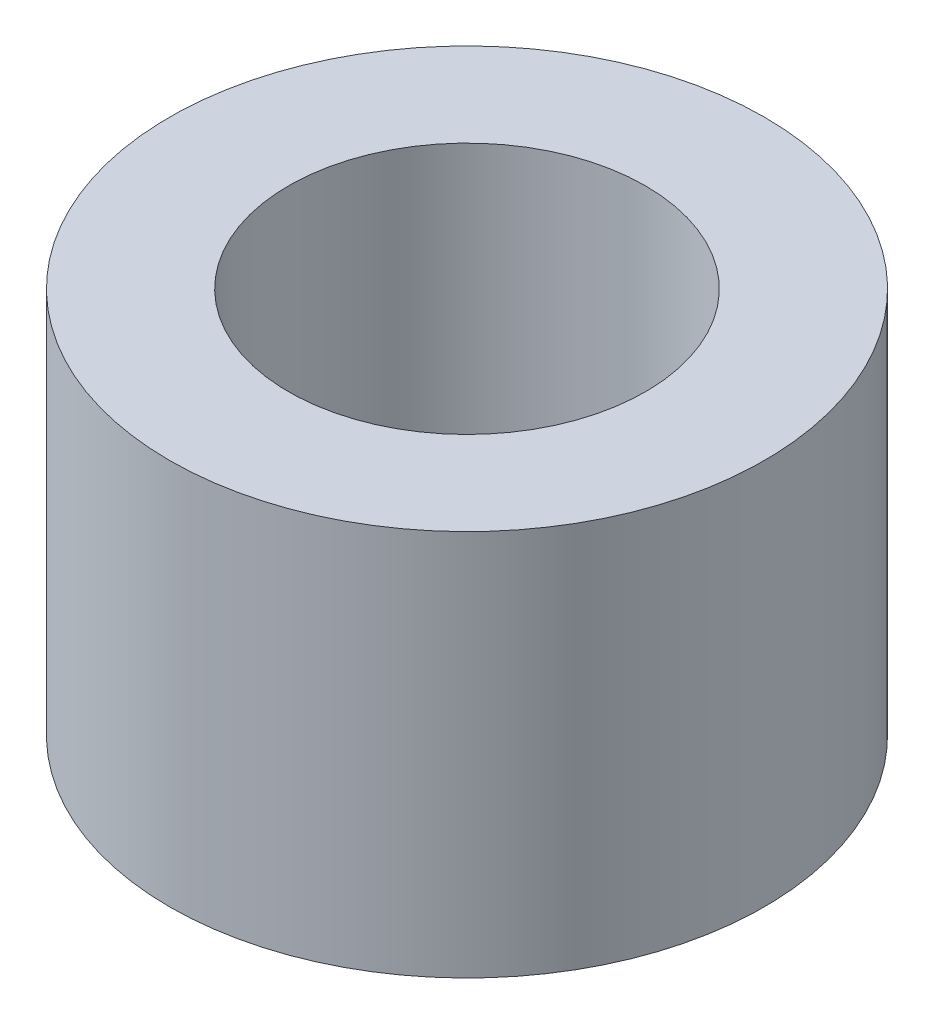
ISO-10303-21;
HEADER;
FILE_DESCRIPTION(('STEP AP214'),'2;1');
FILE_NAME('part.step','',(''),(''),'','','');
FILE_SCHEMA(('AUTOMOTIVE_DESIGN { 1 0 10303 214 1 1 1 1 }'));
ENDSEC;
DATA;
#1=APPLICATION_CONTEXT('core data for automotive mechanical design processes');
#2=APPLICATION_PROTOCOL_DEFINITION('international standard','automotive_design',2000,#1);
#3=PRODUCT_CONTEXT('',#1,'mechanical');
#4=PRODUCT('Part','Part','',(#3));
#5=PRODUCT_RELATED_PRODUCT_CATEGORY('part','',(#4));
#6=PRODUCT_DEFINITION_FORMATION('','',#4);
#7=PRODUCT_DEFINITION_CONTEXT('part definition',#1,'design');
#8=PRODUCT_DEFINITION('design','',#6,#7);
#9=PRODUCT_DEFINITION_SHAPE('','',#8);
#10=(LENGTH_UNIT() NAMED_UNIT(*) SI_UNIT(.MILLI.,.METRE.));
#11=(NAMED_UNIT(*) PLANE_ANGLE_UNIT() SI_UNIT($,.RADIAN.));
#12=(NAMED_UNIT(*) SI_UNIT($,.STERADIAN.) SOLID_ANGLE_UNIT());
#13=UNCERTAINTY_MEASURE_WITH_UNIT(LENGTH_MEASURE(1.E-05),#10,'distance_accuracy_value','');
#14=(GEOMETRIC_REPRESENTATION_CONTEXT(3) GLOBAL_UNCERTAINTY_ASSIGNED_CONTEXT((#13)) GLOBAL_UNIT_ASSIGNED_CONTEXT((#10,
#11,#12)) REPRESENTATION_CONTEXT('',''));
#15=CARTESIAN_POINT('',(0.,0.,0.));
#16=DIRECTION('',(0.,0.,1.));
#17=DIRECTION('',(1.,0.,0.));
#18=AXIS2_PLACEMENT_3D('',#15,#16,#17);
#19=CARTESIAN_POINT('',(0.,6.5,0.));
#20=DIRECTION('',(0.,1.,0.));
#21=DIRECTION('',(0.,0.,1.));
#22=AXIS2_PLACEMENT_3D('',#19,#20,#21);
#23=PLANE('',#22);
#24=CARTESIAN_POINT('',(0.,6.5,0.));
#25=DIRECTION('',(0.,1.,0.));
#26=DIRECTION('',(0.,0.,1.));
#27=AXIS2_PLACEMENT_3D('',#24,#25,#26);
#28=CIRCLE('',#27,5.);
#29=CARTESIAN_POINT('',(0.,6.5,-5.));
#30=VERTEX_POINT('',#29);
#31=EDGE_CURVE('E10',#30,#30,#28,.T.);
#32=ORIENTED_EDGE('',*,*,#31,.T.);
#33=EDGE_LOOP('',(#32));
#34=FACE_BOUND('',#33,.T.);
#35=CARTESIAN_POINT('',(0.,6.5,0.));
#36=DIRECTION('',(0.,1.,0.));
#37=DIRECTION('',(0.,0.,1.));
#38=AXIS2_PLACEMENT_3D('',#35,#36,#37);
#39=CIRCLE('',#38,3.);
#40=CARTESIAN_POINT('',(0.,6.5,-3.));
#41=VERTEX_POINT('',#40);
#42=EDGE_CURVE('E39',#41,#41,#39,.T.);
#43=ORIENTED_EDGE('',*,*,#42,.F.);
#44=EDGE_LOOP('',(#43));
#45=FACE_BOUND('',#44,.T.);
#46=ADVANCED_FACE('F28',(#34,#45),#23,.T.);
#47=CARTESIAN_POINT('',(0.,0.,0.));
#48=DIRECTION('',(0.,1.,0.));
#49=DIRECTION('',(0.,0.,1.));
#50=AXIS2_PLACEMENT_3D('',#47,#48,#49);
#51=PLANE('',#50);
#52=CARTESIAN_POINT('',(0.,0.,0.));
#53=DIRECTION('',(0.,1.,0.));
#54=DIRECTION('',(0.,0.,1.));
#55=AXIS2_PLACEMENT_3D('',#52,#53,#54);
#56=CIRCLE('',#55,5.);
#57=CARTESIAN_POINT('',(0.,0.,-5.));
#58=VERTEX_POINT('',#57);
#59=EDGE_CURVE('E35',#58,#58,#56,.T.);
#60=ORIENTED_EDGE('',*,*,#59,.F.);
#61=EDGE_LOOP('',(#60));
#62=FACE_BOUND('',#61,.T.);
#63=CARTESIAN_POINT('',(0.,0.,0.));
#64=DIRECTION('',(0.,1.,0.));
#65=DIRECTION('',(0.,0.,1.));
#66=AXIS2_PLACEMENT_3D('',#63,#64,#65);
#67=CIRCLE('',#66,3.);
#68=CARTESIAN_POINT('',(0.,0.,-3.));
#69=VERTEX_POINT('',#68);
#70=EDGE_CURVE('E43',#69,#69,#67,.T.);
#71=ORIENTED_EDGE('',*,*,#70,.T.);
#72=EDGE_LOOP('',(#71));
#73=FACE_BOUND('',#72,.T.);
#74=ADVANCED_FACE('F49',(#62,#73),#51,.F.);
#75=CARTESIAN_POINT('',(0.,6.5,0.));
#76=DIRECTION('',(0.,-1.,0.));
#77=DIRECTION('',(0.,0.,-1.));
#78=AXIS2_PLACEMENT_3D('',#75,#76,#77);
#79=CYLINDRICAL_SURFACE('',#78,5.);
#80=CARTESIAN_POINT('',(0.,6.5,-5.));
#81=CARTESIAN_POINT('',(0.,6.43229166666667,-5.));
#82=CARTESIAN_POINT('',(0.,6.36458333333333,-5.));
#83=CARTESIAN_POINT('',(0.,6.22916666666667,-5.));
#84=CARTESIAN_POINT('',(0.,6.16145833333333,-5.));
#85=CARTESIAN_POINT('',(0.,6.02604166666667,-5.));
#86=CARTESIAN_POINT('',(0.,5.95833333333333,-5.));
#87=CARTESIAN_POINT('',(0.,5.82291666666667,-5.));
#88=CARTESIAN_POINT('',(0.,5.75520833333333,-5.));
#89=CARTESIAN_POINT('',(0.,5.61979166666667,-5.));
#90=CARTESIAN_POINT('',(0.,5.55208333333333,-5.));
#91=CARTESIAN_POINT('',(0.,5.41666666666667,-5.));
#92=CARTESIAN_POINT('',(0.,5.34895833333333,-5.));
#93=CARTESIAN_POINT('',(0.,5.21354166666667,-5.));
#94=CARTESIAN_POINT('',(0.,5.14583333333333,-5.));
#95=CARTESIAN_POINT('',(0.,5.01041666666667,-5.));
#96=CARTESIAN_POINT('',(0.,4.94270833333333,-5.));
#97=CARTESIAN_POINT('',(0.,4.80729166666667,-5.));
#98=CARTESIAN_POINT('',(0.,4.73958333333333,-5.));
#99=CARTESIAN_POINT('',(0.,4.60416666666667,-5.));
#100=CARTESIAN_POINT('',(0.,4.53645833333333,-5.));
#101=CARTESIAN_POINT('',(0.,4.40104166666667,-5.));
#102=CARTESIAN_POINT('',(0.,4.33333333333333,-5.));
#103=CARTESIAN_POINT('',(0.,4.19791666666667,-5.));
#104=CARTESIAN_POINT('',(0.,4.13020833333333,-5.));
#105=CARTESIAN_POINT('',(0.,3.99479166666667,-5.));
#106=CARTESIAN_POINT('',(0.,3.92708333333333,-5.));
#107=CARTESIAN_POINT('',(0.,3.79166666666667,-5.));
#108=CARTESIAN_POINT('',(0.,3.72395833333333,-5.));
#109=CARTESIAN_POINT('',(0.,3.58854166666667,-5.));
#110=CARTESIAN_POINT('',(0.,3.52083333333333,-5.));
#111=CARTESIAN_POINT('',(0.,3.38541666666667,-5.));
#112=CARTESIAN_POINT('',(0.,3.31770833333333,-5.));
#113=CARTESIAN_POINT('',(0.,3.18229166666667,-5.));
#114=CARTESIAN_POINT('',(0.,3.11458333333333,-5.));
#115=CARTESIAN_POINT('',(0.,2.97916666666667,-5.));
#116=CARTESIAN_POINT('',(0.,2.91145833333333,-5.));
#117=CARTESIAN_POINT('',(0.,2.77604166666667,-5.));
#118=CARTESIAN_POINT('',(0.,2.70833333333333,-5.));
#119=CARTESIAN_POINT('',(0.,2.57291666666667,-5.));
#120=CARTESIAN_POINT('',(0.,2.50520833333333,-5.));
#121=CARTESIAN_POINT('',(0.,2.36979166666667,-5.));
#122=CARTESIAN_POINT('',(0.,2.30208333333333,-5.));
#123=CARTESIAN_POINT('',(0.,2.16666666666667,-5.));
#124=CARTESIAN_POINT('',(0.,2.09895833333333,-5.));
#125=CARTESIAN_POINT('',(0.,1.96354166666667,-5.));
#126=CARTESIAN_POINT('',(0.,1.89583333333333,-5.));
#127=CARTESIAN_POINT('',(0.,1.76041666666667,-5.));
#128=CARTESIAN_POINT('',(0.,1.69270833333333,-5.));
#129=CARTESIAN_POINT('',(0.,1.55729166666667,-5.));
#130=CARTESIAN_POINT('',(0.,1.48958333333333,-5.));
#131=CARTESIAN_POINT('',(0.,1.35416666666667,-5.));
#132=CARTESIAN_POINT('',(0.,1.28645833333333,-5.));
#133=CARTESIAN_POINT('',(0.,1.15104166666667,-5.));
#134=CARTESIAN_POINT('',(0.,1.08333333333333,-5.));
#135=CARTESIAN_POINT('',(0.,0.947916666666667,-5.));
#136=CARTESIAN_POINT('',(0.,0.880208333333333,-5.));
#137=CARTESIAN_POINT('',(0.,0.744791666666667,-5.));
#138=CARTESIAN_POINT('',(0.,0.677083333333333,-5.));
#139=CARTESIAN_POINT('',(0.,0.541666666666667,-5.));
#140=CARTESIAN_POINT('',(0.,0.473958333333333,-5.));
#141=CARTESIAN_POINT('',(0.,0.338541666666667,-5.));
#142=CARTESIAN_POINT('',(0.,0.270833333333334,-5.));
#143=CARTESIAN_POINT('',(0.,0.135416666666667,-5.));
#144=CARTESIAN_POINT('',(0.,0.0677083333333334,-5.));
#145=CARTESIAN_POINT('',(0.,0.,-5.));
#146=B_SPLINE_CURVE_WITH_KNOTS('',3,(#80,#81,#82,#83,#84,#85,#86,#87,#88,#89,#90,#91,#92,#93,
#94,#95,#96,#97,#98,#99,#100,#101,#102,#103,#104,#105,#106,#107,#108,#109,#110,#111,#112,#113,
#114,#115,#116,#117,#118,#119,#120,#121,#122,#123,#124,#125,#126,#127,#128,#129,#130,#131,#132,
#133,#134,#135,#136,#137,#138,#139,#140,#141,#142,#143,#144,#145),.UNSPECIFIED.,.F.,.F.,(4,2,2,
2,2,2,2,2,2,2,2,2,2,2,2,2,2,2,2,2,2,2,2,2,2,2,2,2,2,2,2,2,4),(0.,0.203125,0.40625,
0.609375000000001,0.812500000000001,1.015625,1.21875,1.421875,1.625,1.828125,2.03125,2.234375,
2.4375,2.640625,2.84375,3.046875,3.25,3.453125,3.65625,3.859375,4.0625,4.265625,4.46875,
4.671875,4.875,5.078125,5.28125,5.484375,5.6875,5.890625,6.09375,6.296875,6.5),.UNSPECIFIED.);
#147=EDGE_CURVE('BSEAM30',#30,#58,#146,.T.);
#148=ORIENTED_EDGE('',*,*,#31,.F.);
#149=ORIENTED_EDGE('',*,*,#59,.T.);
#150=ORIENTED_EDGE('',*,*,#147,.T.);
#151=ORIENTED_EDGE('',*,*,#147,.F.);
#152=EDGE_LOOP('',(#148,#150,#149,#151));
#153=FACE_BOUND('',#152,.T.);
#154=ADVANCED_FACE('F30',(#153),#79,.T.);
#155=CARTESIAN_POINT('',(0.,6.5,0.));
#156=DIRECTION('',(0.,-1.,0.));
#157=DIRECTION('',(0.,0.,-1.));
#158=AXIS2_PLACEMENT_3D('',#155,#156,#157);
#159=CYLINDRICAL_SURFACE('',#158,3.);
#160=CARTESIAN_POINT('',(0.,6.5,-3.));
#161=CARTESIAN_POINT('',(0.,6.43229166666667,-3.));
#162=CARTESIAN_POINT('',(0.,6.36458333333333,-3.));
#163=CARTESIAN_POINT('',(0.,6.22916666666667,-3.));
#164=CARTESIAN_POINT('',(0.,6.16145833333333,-3.));
#165=CARTESIAN_POINT('',(0.,6.02604166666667,-3.));
#166=CARTESIAN_POINT('',(0.,5.95833333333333,-3.));
#167=CARTESIAN_POINT('',(0.,5.82291666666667,-3.));
#168=CARTESIAN_POINT('',(0.,5.75520833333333,-3.));
#169=CARTESIAN_POINT('',(0.,5.61979166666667,-3.));
#170=CARTESIAN_POINT('',(0.,5.55208333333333,-3.));
#171=CARTESIAN_POINT('',(0.,5.41666666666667,-3.));
#172=CARTESIAN_POINT('',(0.,5.34895833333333,-3.));
#173=CARTESIAN_POINT('',(0.,5.21354166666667,-3.));
#174=CARTESIAN_POINT('',(0.,5.14583333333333,-3.));
#175=CARTESIAN_POINT('',(0.,5.01041666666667,-3.));
#176=CARTESIAN_POINT('',(0.,4.94270833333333,-3.));
#177=CARTESIAN_POINT('',(0.,4.80729166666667,-3.));
#178=CARTESIAN_POINT('',(0.,4.73958333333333,-3.));
#179=CARTESIAN_POINT('',(0.,4.60416666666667,-3.));
#180=CARTESIAN_POINT('',(0.,4.53645833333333,-3.));
#181=CARTESIAN_POINT('',(0.,4.40104166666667,-3.));
#182=CARTESIAN_POINT('',(0.,4.33333333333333,-3.));
#183=CARTESIAN_POINT('',(0.,4.19791666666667,-3.));
#184=CARTESIAN_POINT('',(0.,4.13020833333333,-3.));
#185=CARTESIAN_POINT('',(0.,3.99479166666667,-3.));
#186=CARTESIAN_POINT('',(0.,3.92708333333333,-3.));
#187=CARTESIAN_POINT('',(0.,3.79166666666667,-3.));
#188=CARTESIAN_POINT('',(0.,3.72395833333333,-3.));
#189=CARTESIAN_POINT('',(0.,3.58854166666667,-3.));
#190=CARTESIAN_POINT('',(0.,3.52083333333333,-3.));
#191=CARTESIAN_POINT('',(0.,3.38541666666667,-3.));
#192=CARTESIAN_POINT('',(0.,3.31770833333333,-3.));
#193=CARTESIAN_POINT('',(0.,3.18229166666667,-3.));
#194=CARTESIAN_POINT('',(0.,3.11458333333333,-3.));
#195=CARTESIAN_POINT('',(0.,2.97916666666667,-3.));
#196=CARTESIAN_POINT('',(0.,2.91145833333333,-3.));
#197=CARTESIAN_POINT('',(0.,2.77604166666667,-3.));
#198=CARTESIAN_POINT('',(0.,2.70833333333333,-3.));
#199=CARTESIAN_POINT('',(0.,2.57291666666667,-3.));
#200=CARTESIAN_POINT('',(0.,2.50520833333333,-3.));
#201=CARTESIAN_POINT('',(0.,2.36979166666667,-3.));
#202=CARTESIAN_POINT('',(0.,2.30208333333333,-3.));
#203=CARTESIAN_POINT('',(0.,2.16666666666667,-3.));
#204=CARTESIAN_POINT('',(0.,2.09895833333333,-3.));
#205=CARTESIAN_POINT('',(0.,1.96354166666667,-3.));
#206=CARTESIAN_POINT('',(0.,1.89583333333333,-3.));
#207=CARTESIAN_POINT('',(0.,1.76041666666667,-3.));
#208=CARTESIAN_POINT('',(0.,1.69270833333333,-3.));
#209=CARTESIAN_POINT('',(0.,1.55729166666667,-3.));
#210=CARTESIAN_POINT('',(0.,1.48958333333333,-3.));
#211=CARTESIAN_POINT('',(0.,1.35416666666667,-3.));
#212=CARTESIAN_POINT('',(0.,1.28645833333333,-3.));
#213=CARTESIAN_POINT('',(0.,1.15104166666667,-3.));
#214=CARTESIAN_POINT('',(0.,1.08333333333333,-3.));
#215=CARTESIAN_POINT('',(0.,0.947916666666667,-3.));
#216=CARTESIAN_POINT('',(0.,0.880208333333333,-3.));
#217=CARTESIAN_POINT('',(0.,0.744791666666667,-3.));
#218=CARTESIAN_POINT('',(0.,0.677083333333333,-3.));
#219=CARTESIAN_POINT('',(0.,0.541666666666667,-3.));
#220=CARTESIAN_POINT('',(0.,0.473958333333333,-3.));
#221=CARTESIAN_POINT('',(0.,0.338541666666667,-3.));
#222=CARTESIAN_POINT('',(0.,0.270833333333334,-3.));
#223=CARTESIAN_POINT('',(0.,0.135416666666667,-3.));
#224=CARTESIAN_POINT('',(0.,0.0677083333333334,-3.));
#225=CARTESIAN_POINT('',(0.,0.,-3.));
#226=B_SPLINE_CURVE_WITH_KNOTS('',3,(#160,#161,#162,#163,#164,#165,#166,#167,#168,#169,#170,
#171,#172,#173,#174,#175,#176,#177,#178,#179,#180,#181,#182,#183,#184,#185,#186,#187,#188,#189,
#190,#191,#192,#193,#194,#195,#196,#197,#198,#199,#200,#201,#202,#203,#204,#205,#206,#207,#208,
#209,#210,#211,#212,#213,#214,#215,#216,#217,#218,#219,#220,#221,#222,#223,#224,#225),
.UNSPECIFIED.,.F.,.F.,(4,2,2,2,2,2,2,2,2,2,2,2,2,2,2,2,2,2,2,2,2,2,2,2,2,2,2,2,2,2,2,2,4),(0.,
0.203125,0.40625,0.609375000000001,0.812500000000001,1.015625,1.21875,1.421875,1.625,1.828125,
2.03125,2.234375,2.4375,2.640625,2.84375,3.046875,3.25,3.453125,3.65625,3.859375,4.0625,
4.265625,4.46875,4.671875,4.875,5.078125,5.28125,5.484375,5.6875,5.890625,6.09375,6.296875,6.5),.UNSPECIFIED.);
#227=EDGE_CURVE('BSEAM51',#41,#69,#226,.T.);
#228=ORIENTED_EDGE('',*,*,#42,.T.);
#229=ORIENTED_EDGE('',*,*,#70,.F.);
#230=ORIENTED_EDGE('',*,*,#227,.T.);
#231=ORIENTED_EDGE('',*,*,#227,.F.);
#232=EDGE_LOOP('',(#228,#230,#229,#231));
#233=FACE_BOUND('',#232,.T.);
#234=ADVANCED_FACE('F51',(#233),#159,.F.);
#235=CLOSED_SHELL('',(#46,#74,#154,#234));
#236=MANIFOLD_SOLID_BREP('B2',#235);
#237=ADVANCED_BREP_SHAPE_REPRESENTATION('',(#18,#236),#14);
#238=SHAPE_DEFINITION_REPRESENTATION(#9,#237);
ENDSEC;
END-ISO-10303-21;
